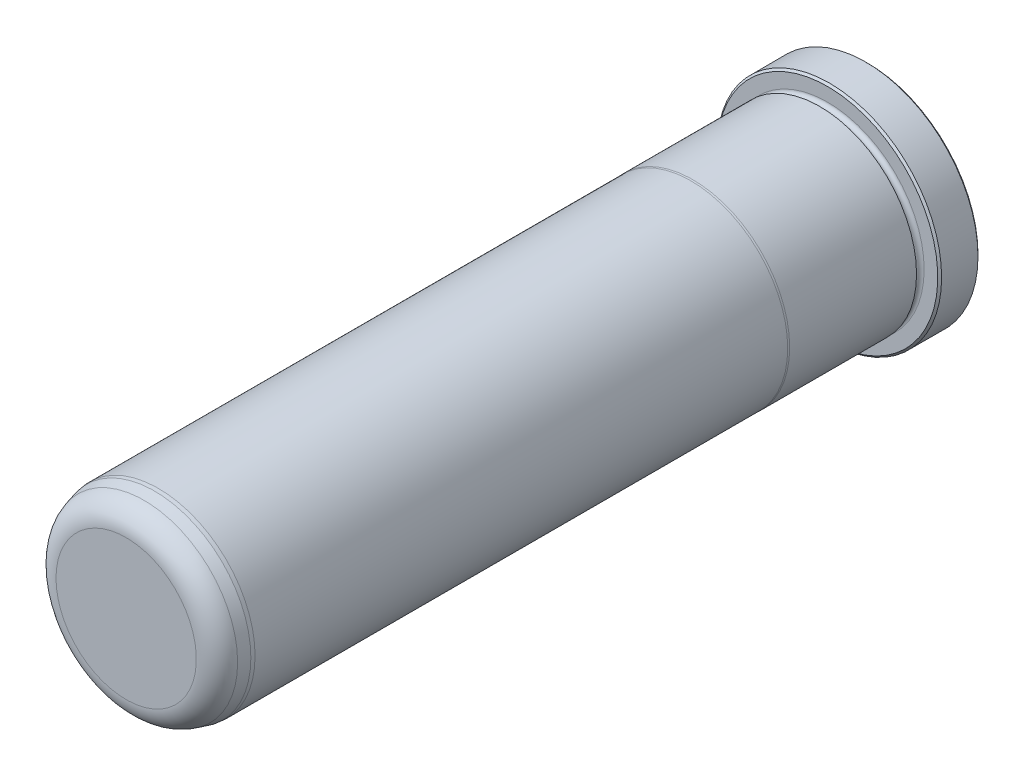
from build123d import *

# Parameters (mm, degrees)
FILLET6_R     = 4.7625
CHAMFER1_SIZE = 0.381


with BuildPart() as part:
    # Sketch1 → Revolve1 (revolve)
    with BuildSketch(Plane(origin=(0, 0, 0), x_dir=(0, 0, -1), z_dir=(1, 0, 0)), mode=Mode.PRIVATE) as revolve1_sk:
        with BuildLine():
            Line((0, 0), (0, 22.098))
            Line((0, 22.098), (-7.9248, 22.098))
            Line((-7.9248, 22.098), (-7.9248, 19.0373))
            ThreePointArc((-7.9248, 19.0373), (-8.6868, 18.2753), (-9.4488, 19.0373))
            Line((-9.4488, 19.0373), (-9.4488, 19.0627))
            Line((-9.4488, 19.0627), (-34.434763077, 19.0627))
            Line((-34.434763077, 19.0627), (-34.798, 19.0373))
            Line((-34.798, 19.0373), (-139.7, 19.0373))
            Line((-139.7, 19.0373), (-140.462, 18.970633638))
            Line((-140.462, 18.970633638), (-146.05, 17.473333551))
            Line((-146.05, 17.473333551), (-146.05, 0))
            Line((-146.05, 0), (0, 0))
        make_face()
    revolve(revolve1_sk.sketch.rotate(Axis((0, 0, 0), (0, 0, -1)), 90), axis=Axis((0, 0, 0), (0, 0, -1)))

    # Fillet6
    fillet6_edges = [part.edges().sort_by_distance(p)[0] for p in [
        (-17.473333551, 0, 146.05),
    ]]
    fillet(fillet6_edges, radius=FILLET6_R)

    # Chamfer1
    chamfer1_edges = [part.edges().sort_by_distance(p)[0] for p in [
        (-22.098, 0, 7.9248),
        (-22.098, 0, 0),
    ]]
    chamfer(chamfer1_edges, length=CHAMFER1_SIZE)


solid = part.part
